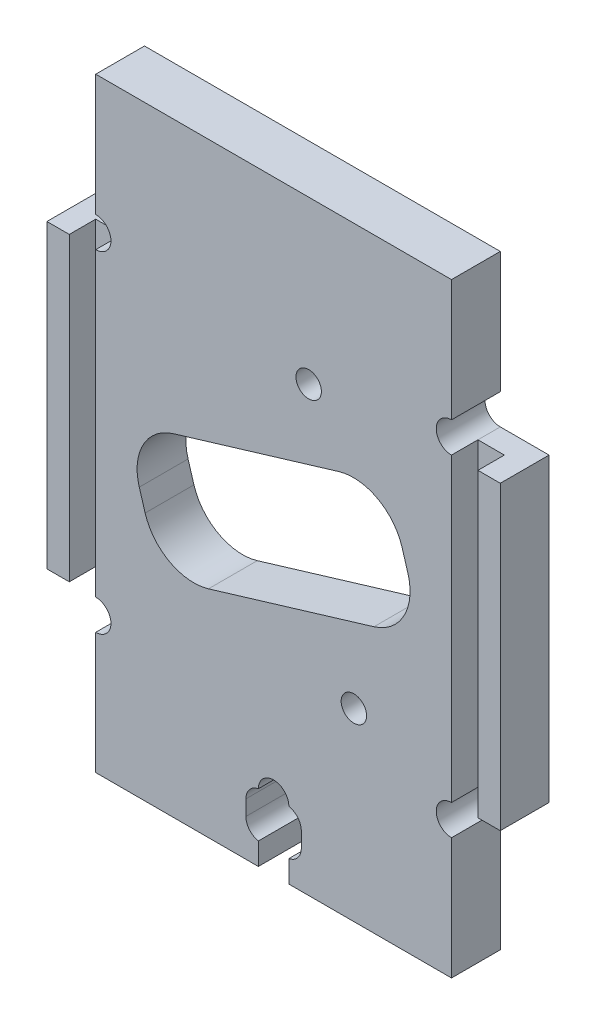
ISO-10303-21;
HEADER;
FILE_DESCRIPTION(('STEP AP214'),'2;1');
FILE_NAME('part.step','',(''),(''),'','','');
FILE_SCHEMA(('AUTOMOTIVE_DESIGN { 1 0 10303 214 1 1 1 1 }'));
ENDSEC;
DATA;
#1=APPLICATION_CONTEXT('core data for automotive mechanical design processes');
#2=APPLICATION_PROTOCOL_DEFINITION('international standard','automotive_design',2000,#1);
#3=PRODUCT_CONTEXT('',#1,'mechanical');
#4=PRODUCT('Part','Part','',(#3));
#5=PRODUCT_RELATED_PRODUCT_CATEGORY('part','',(#4));
#6=PRODUCT_DEFINITION_FORMATION('','',#4);
#7=PRODUCT_DEFINITION_CONTEXT('part definition',#1,'design');
#8=PRODUCT_DEFINITION('design','',#6,#7);
#9=PRODUCT_DEFINITION_SHAPE('','',#8);
#10=(LENGTH_UNIT() NAMED_UNIT(*) SI_UNIT(.MILLI.,.METRE.));
#11=(NAMED_UNIT(*) PLANE_ANGLE_UNIT() SI_UNIT($,.RADIAN.));
#12=(NAMED_UNIT(*) SI_UNIT($,.STERADIAN.) SOLID_ANGLE_UNIT());
#13=UNCERTAINTY_MEASURE_WITH_UNIT(LENGTH_MEASURE(1.E-05),#10,'distance_accuracy_value','');
#14=(GEOMETRIC_REPRESENTATION_CONTEXT(3) GLOBAL_UNCERTAINTY_ASSIGNED_CONTEXT((#13)) GLOBAL_UNIT_ASSIGNED_CONTEXT((#10,
#11,#12)) REPRESENTATION_CONTEXT('',''));
#15=CARTESIAN_POINT('',(0.,0.,0.));
#16=DIRECTION('',(0.,0.,1.));
#17=DIRECTION('',(1.,0.,0.));
#18=AXIS2_PLACEMENT_3D('',#15,#16,#17);
#19=CARTESIAN_POINT('',(-17.5,-15.95,-69.7151058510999));
#20=DIRECTION('',(0.,0.,1.));
#21=DIRECTION('',(1.,0.,0.));
#22=AXIS2_PLACEMENT_3D('',#19,#20,#21);
#23=CYLINDRICAL_SURFACE('',#22,1.5);
#24=CARTESIAN_POINT('',(-17.5,-15.95,0.));
#25=DIRECTION('',(0.,0.,-1.));
#26=DIRECTION('',(-1.,0.,0.));
#27=AXIS2_PLACEMENT_3D('',#24,#25,#26);
#28=CIRCLE('',#27,1.5);
#29=CARTESIAN_POINT('',(-17.5,-14.45,0.));
#30=VERTEX_POINT('',#29);
#31=CARTESIAN_POINT('',(-17.5,-17.45,0.));
#32=VERTEX_POINT('',#31);
#33=EDGE_CURVE('E511',#30,#32,#28,.T.);
#34=ORIENTED_EDGE('',*,*,#33,.T.);
#35=DIRECTION('',(0.,0.,1.));
#36=VECTOR('',#35,1.);
#37=CARTESIAN_POINT('',(-17.5,-17.45,-69.7151058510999));
#38=LINE('',#37,#36);
#39=CARTESIAN_POINT('',(-17.5,-17.45,4.8));
#40=VERTEX_POINT('',#39);
#41=EDGE_CURVE('E364',#32,#40,#38,.T.);
#42=ORIENTED_EDGE('',*,*,#41,.T.);
#43=CARTESIAN_POINT('',(-17.5,-15.95,4.8));
#44=DIRECTION('',(0.,0.,1.));
#45=DIRECTION('',(-1.,0.,0.));
#46=AXIS2_PLACEMENT_3D('',#43,#44,#45);
#47=CIRCLE('',#46,1.5);
#48=CARTESIAN_POINT('',(-17.5,-14.45,4.8));
#49=VERTEX_POINT('',#48);
#50=EDGE_CURVE('E362',#40,#49,#47,.T.);
#51=ORIENTED_EDGE('',*,*,#50,.T.);
#52=DIRECTION('',(0.,0.,1.));
#53=VECTOR('',#52,1.);
#54=CARTESIAN_POINT('',(-17.5,-14.45,-69.7151058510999));
#55=LINE('',#54,#53);
#56=CARTESIAN_POINT('',(-17.5,-14.45,2.2));
#57=VERTEX_POINT('',#56);
#58=EDGE_CURVE('E348',#57,#49,#55,.T.);
#59=ORIENTED_EDGE('',*,*,#58,.F.);
#60=DIRECTION('',(0.,0.,-1.));
#61=VECTOR('',#60,1.);
#62=CARTESIAN_POINT('',(-17.5,-14.45,2.2));
#63=LINE('',#62,#61);
#64=EDGE_CURVE('E489',#57,#30,#63,.T.);
#65=ORIENTED_EDGE('',*,*,#64,.T.);
#66=EDGE_LOOP('',(#34,#42,#51,#59,#65));
#67=FACE_BOUND('',#66,.T.);
#68=ADVANCED_FACE('F16',(#67),#23,.F.);
#69=CARTESIAN_POINT('',(17.5,-15.95,-69.7151058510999));
#70=DIRECTION('',(0.,0.,1.));
#71=DIRECTION('',(1.,0.,0.));
#72=AXIS2_PLACEMENT_3D('',#69,#70,#71);
#73=CYLINDRICAL_SURFACE('',#72,1.5);
#74=DIRECTION('',(0.,0.,-1.));
#75=VECTOR('',#74,1.);
#76=CARTESIAN_POINT('',(17.5,-14.45,2.2));
#77=LINE('',#76,#75);
#78=CARTESIAN_POINT('',(17.5,-14.45,2.2));
#79=VERTEX_POINT('',#78);
#80=CARTESIAN_POINT('',(17.5,-14.45,0.));
#81=VERTEX_POINT('',#80);
#82=EDGE_CURVE('E129',#79,#81,#77,.T.);
#83=ORIENTED_EDGE('',*,*,#82,.F.);
#84=DIRECTION('',(0.,0.,1.));
#85=VECTOR('',#84,1.);
#86=CARTESIAN_POINT('',(17.5,-14.45,-69.7151058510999));
#87=LINE('',#86,#85);
#88=CARTESIAN_POINT('',(17.5,-14.45,4.8));
#89=VERTEX_POINT('',#88);
#90=EDGE_CURVE('E531',#79,#89,#87,.T.);
#91=ORIENTED_EDGE('',*,*,#90,.T.);
#92=CARTESIAN_POINT('',(17.5,-15.95,4.8));
#93=DIRECTION('',(0.,0.,-1.));
#94=DIRECTION('',(1.,0.,0.));
#95=AXIS2_PLACEMENT_3D('',#92,#93,#94);
#96=CIRCLE('',#95,1.5);
#97=CARTESIAN_POINT('',(17.5,-17.45,4.8));
#98=VERTEX_POINT('',#97);
#99=EDGE_CURVE('E539',#98,#89,#96,.T.);
#100=ORIENTED_EDGE('',*,*,#99,.F.);
#101=DIRECTION('',(0.,0.,1.));
#102=VECTOR('',#101,1.);
#103=CARTESIAN_POINT('',(17.5,-17.45,-69.7151058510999));
#104=LINE('',#103,#102);
#105=CARTESIAN_POINT('',(17.5,-17.45,0.));
#106=VERTEX_POINT('',#105);
#107=EDGE_CURVE('E460',#106,#98,#104,.T.);
#108=ORIENTED_EDGE('',*,*,#107,.F.);
#109=CARTESIAN_POINT('',(17.5,-15.95,0.));
#110=DIRECTION('',(0.,0.,1.));
#111=DIRECTION('',(-1.,0.,0.));
#112=AXIS2_PLACEMENT_3D('',#109,#110,#111);
#113=CIRCLE('',#112,1.5);
#114=EDGE_CURVE('E569',#81,#106,#113,.T.);
#115=ORIENTED_EDGE('',*,*,#114,.F.);
#116=EDGE_LOOP('',(#83,#91,#100,#108,#115));
#117=FACE_BOUND('',#116,.T.);
#118=ADVANCED_FACE('F840',(#117),#73,.F.);
#119=CARTESIAN_POINT('',(17.5,16.65,-69.7151058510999));
#120=DIRECTION('',(0.,0.,1.));
#121=DIRECTION('',(1.,0.,0.));
#122=AXIS2_PLACEMENT_3D('',#119,#120,#121);
#123=CYLINDRICAL_SURFACE('',#122,1.5);
#124=CARTESIAN_POINT('',(17.5,16.65,0.));
#125=DIRECTION('',(0.,0.,-1.));
#126=DIRECTION('',(-1.,0.,0.));
#127=AXIS2_PLACEMENT_3D('',#124,#125,#126);
#128=CIRCLE('',#127,1.5);
#129=CARTESIAN_POINT('',(17.5,15.15,0.));
#130=VERTEX_POINT('',#129);
#131=CARTESIAN_POINT('',(17.5,18.15,0.));
#132=VERTEX_POINT('',#131);
#133=EDGE_CURVE('E461',#130,#132,#128,.T.);
#134=ORIENTED_EDGE('',*,*,#133,.T.);
#135=DIRECTION('',(0.,0.,1.));
#136=VECTOR('',#135,1.);
#137=CARTESIAN_POINT('',(17.5,18.15,-69.7151058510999));
#138=LINE('',#137,#136);
#139=CARTESIAN_POINT('',(17.5,18.15,4.8));
#140=VERTEX_POINT('',#139);
#141=EDGE_CURVE('E459',#132,#140,#138,.T.);
#142=ORIENTED_EDGE('',*,*,#141,.T.);
#143=CARTESIAN_POINT('',(17.5,16.65,4.8));
#144=DIRECTION('',(0.,0.,1.));
#145=DIRECTION('',(1.,0.,0.));
#146=AXIS2_PLACEMENT_3D('',#143,#144,#145);
#147=CIRCLE('',#146,1.5);
#148=CARTESIAN_POINT('',(17.5,15.15,4.8));
#149=VERTEX_POINT('',#148);
#150=EDGE_CURVE('E521',#140,#149,#147,.T.);
#151=ORIENTED_EDGE('',*,*,#150,.T.);
#152=DIRECTION('',(0.,0.,1.));
#153=VECTOR('',#152,1.);
#154=CARTESIAN_POINT('',(17.5,15.15,-69.7151058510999));
#155=LINE('',#154,#153);
#156=CARTESIAN_POINT('',(17.5,15.15,2.2));
#157=VERTEX_POINT('',#156);
#158=EDGE_CURVE('E660',#157,#149,#155,.T.);
#159=ORIENTED_EDGE('',*,*,#158,.F.);
#160=DIRECTION('',(0.,0.,1.));
#161=VECTOR('',#160,1.);
#162=CARTESIAN_POINT('',(17.5,15.15,0.));
#163=LINE('',#162,#161);
#164=EDGE_CURVE('E10',#130,#157,#163,.T.);
#165=ORIENTED_EDGE('',*,*,#164,.F.);
#166=EDGE_LOOP('',(#134,#142,#151,#159,#165));
#167=FACE_BOUND('',#166,.T.);
#168=ADVANCED_FACE('F815',(#167),#123,.F.);
#169=CARTESIAN_POINT('',(-17.5,16.65,-69.7151058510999));
#170=DIRECTION('',(0.,0.,1.));
#171=DIRECTION('',(1.,0.,0.));
#172=AXIS2_PLACEMENT_3D('',#169,#170,#171);
#173=CYLINDRICAL_SURFACE('',#172,1.5);
#174=DIRECTION('',(0.,0.,1.));
#175=VECTOR('',#174,1.);
#176=CARTESIAN_POINT('',(-17.5,15.15,0.));
#177=LINE('',#176,#175);
#178=CARTESIAN_POINT('',(-17.5,15.15,0.));
#179=VERTEX_POINT('',#178);
#180=CARTESIAN_POINT('',(-17.5,15.15,2.2));
#181=VERTEX_POINT('',#180);
#182=EDGE_CURVE('E27',#179,#181,#177,.T.);
#183=ORIENTED_EDGE('',*,*,#182,.T.);
#184=DIRECTION('',(0.,0.,1.));
#185=VECTOR('',#184,1.);
#186=CARTESIAN_POINT('',(-17.5,15.15,-69.7151058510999));
#187=LINE('',#186,#185);
#188=CARTESIAN_POINT('',(-17.5,15.15,4.8));
#189=VERTEX_POINT('',#188);
#190=EDGE_CURVE('E358',#181,#189,#187,.T.);
#191=ORIENTED_EDGE('',*,*,#190,.T.);
#192=CARTESIAN_POINT('',(-17.5,16.65,4.8));
#193=DIRECTION('',(0.,0.,-1.));
#194=DIRECTION('',(-1.,0.,0.));
#195=AXIS2_PLACEMENT_3D('',#192,#193,#194);
#196=CIRCLE('',#195,1.5);
#197=CARTESIAN_POINT('',(-17.5,18.15,4.8));
#198=VERTEX_POINT('',#197);
#199=EDGE_CURVE('E376',#198,#189,#196,.T.);
#200=ORIENTED_EDGE('',*,*,#199,.F.);
#201=DIRECTION('',(0.,0.,1.));
#202=VECTOR('',#201,1.);
#203=CARTESIAN_POINT('',(-17.5,18.15,-69.7151058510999));
#204=LINE('',#203,#202);
#205=CARTESIAN_POINT('',(-17.5,18.15,0.));
#206=VERTEX_POINT('',#205);
#207=EDGE_CURVE('E634',#206,#198,#204,.T.);
#208=ORIENTED_EDGE('',*,*,#207,.F.);
#209=CARTESIAN_POINT('',(-17.5,16.65,0.));
#210=DIRECTION('',(0.,0.,1.));
#211=DIRECTION('',(-1.,0.,0.));
#212=AXIS2_PLACEMENT_3D('',#209,#210,#211);
#213=CIRCLE('',#212,1.5);
#214=EDGE_CURVE('E628',#179,#206,#213,.T.);
#215=ORIENTED_EDGE('',*,*,#214,.F.);
#216=EDGE_LOOP('',(#183,#191,#200,#208,#215));
#217=FACE_BOUND('',#216,.T.);
#218=ADVANCED_FACE('F18',(#217),#173,.F.);
#219=CARTESIAN_POINT('',(0.,15.15,0.));
#220=DIRECTION('',(0.,1.,0.));
#221=DIRECTION('',(1.,0.,0.));
#222=AXIS2_PLACEMENT_3D('',#219,#220,#221);
#223=PLANE('',#222);
#224=DIRECTION('',(0.,0.,1.));
#225=VECTOR('',#224,1.);
#226=CARTESIAN_POINT('',(20.1,15.15,2.2));
#227=LINE('',#226,#225);
#228=CARTESIAN_POINT('',(20.1,15.15,2.2));
#229=VERTEX_POINT('',#228);
#230=CARTESIAN_POINT('',(20.1,15.15,4.8));
#231=VERTEX_POINT('',#230);
#232=EDGE_CURVE('E624',#229,#231,#227,.T.);
#233=ORIENTED_EDGE('',*,*,#232,.T.);
#234=DIRECTION('',(1.,0.,0.));
#235=VECTOR('',#234,1.);
#236=CARTESIAN_POINT('',(20.1,15.15,4.8));
#237=LINE('',#236,#235);
#238=CARTESIAN_POINT('',(22.3,15.15,4.8));
#239=VERTEX_POINT('',#238);
#240=EDGE_CURVE('E492',#231,#239,#237,.T.);
#241=ORIENTED_EDGE('',*,*,#240,.T.);
#242=DIRECTION('',(0.,0.,-1.));
#243=VECTOR('',#242,1.);
#244=CARTESIAN_POINT('',(22.3,15.15,4.8));
#245=LINE('',#244,#243);
#246=CARTESIAN_POINT('',(22.3,15.15,0.));
#247=VERTEX_POINT('',#246);
#248=EDGE_CURVE('E484',#239,#247,#245,.T.);
#249=ORIENTED_EDGE('',*,*,#248,.T.);
#250=DIRECTION('',(-1.,0.,0.));
#251=VECTOR('',#250,1.);
#252=CARTESIAN_POINT('',(22.3,15.15,0.));
#253=LINE('',#252,#251);
#254=EDGE_CURVE('E465',#247,#130,#253,.T.);
#255=ORIENTED_EDGE('',*,*,#254,.T.);
#256=ORIENTED_EDGE('',*,*,#164,.T.);
#257=DIRECTION('',(1.,0.,0.));
#258=VECTOR('',#257,1.);
#259=CARTESIAN_POINT('',(17.5,15.15,2.2));
#260=LINE('',#259,#258);
#261=EDGE_CURVE('E664',#157,#229,#260,.T.);
#262=ORIENTED_EDGE('',*,*,#261,.T.);
#263=EDGE_LOOP('',(#233,#241,#249,#255,#256,#262));
#264=FACE_BOUND('',#263,.T.);
#265=ADVANCED_FACE('F819',(#264),#223,.T.);
#266=CARTESIAN_POINT('',(0.,15.15,0.));
#267=DIRECTION('',(0.,-1.,0.));
#268=DIRECTION('',(0.,0.,-1.));
#269=AXIS2_PLACEMENT_3D('',#266,#267,#268);
#270=PLANE('',#269);
#271=DIRECTION('',(-1.,0.,0.));
#272=VECTOR('',#271,1.);
#273=CARTESIAN_POINT('',(-20.1,15.15,4.8));
#274=LINE('',#273,#272);
#275=CARTESIAN_POINT('',(-20.1,15.15,4.8));
#276=VERTEX_POINT('',#275);
#277=CARTESIAN_POINT('',(-22.3,15.15,4.8));
#278=VERTEX_POINT('',#277);
#279=EDGE_CURVE('E405',#276,#278,#274,.T.);
#280=ORIENTED_EDGE('',*,*,#279,.F.);
#281=DIRECTION('',(0.,0.,1.));
#282=VECTOR('',#281,1.);
#283=CARTESIAN_POINT('',(-20.1,15.15,2.2));
#284=LINE('',#283,#282);
#285=CARTESIAN_POINT('',(-20.1,15.15,2.2));
#286=VERTEX_POINT('',#285);
#287=EDGE_CURVE('E71',#286,#276,#284,.T.);
#288=ORIENTED_EDGE('',*,*,#287,.F.);
#289=DIRECTION('',(-1.,0.,0.));
#290=VECTOR('',#289,1.);
#291=CARTESIAN_POINT('',(-17.5,15.15,2.2));
#292=LINE('',#291,#290);
#293=EDGE_CURVE('E674',#181,#286,#292,.T.);
#294=ORIENTED_EDGE('',*,*,#293,.F.);
#295=ORIENTED_EDGE('',*,*,#182,.F.);
#296=DIRECTION('',(1.,0.,0.));
#297=VECTOR('',#296,1.);
#298=CARTESIAN_POINT('',(-22.3,15.15,0.));
#299=LINE('',#298,#297);
#300=CARTESIAN_POINT('',(-22.3,15.15,0.));
#301=VERTEX_POINT('',#300);
#302=EDGE_CURVE('E453',#301,#179,#299,.T.);
#303=ORIENTED_EDGE('',*,*,#302,.F.);
#304=DIRECTION('',(0.,0.,-1.));
#305=VECTOR('',#304,1.);
#306=CARTESIAN_POINT('',(-22.3,15.15,4.8));
#307=LINE('',#306,#305);
#308=EDGE_CURVE('E488',#278,#301,#307,.T.);
#309=ORIENTED_EDGE('',*,*,#308,.F.);
#310=EDGE_LOOP('',(#280,#288,#294,#295,#303,#309));
#311=FACE_BOUND('',#310,.T.);
#312=ADVANCED_FACE('F771',(#311),#270,.F.);
#313=CARTESIAN_POINT('',(0.,-14.45,0.));
#314=DIRECTION('',(0.,-1.,0.));
#315=DIRECTION('',(0.,0.,-1.));
#316=AXIS2_PLACEMENT_3D('',#313,#314,#315);
#317=PLANE('',#316);
#318=DIRECTION('',(0.,0.,1.));
#319=VECTOR('',#318,1.);
#320=CARTESIAN_POINT('',(22.3,-14.45,0.));
#321=LINE('',#320,#319);
#322=CARTESIAN_POINT('',(22.3,-14.45,0.));
#323=VERTEX_POINT('',#322);
#324=CARTESIAN_POINT('',(22.3,-14.45,4.8));
#325=VERTEX_POINT('',#324);
#326=EDGE_CURVE('E140',#323,#325,#321,.T.);
#327=ORIENTED_EDGE('',*,*,#326,.T.);
#328=DIRECTION('',(-1.,0.,0.));
#329=VECTOR('',#328,1.);
#330=CARTESIAN_POINT('',(22.3,-14.45,4.8));
#331=LINE('',#330,#329);
#332=CARTESIAN_POINT('',(20.1,-14.45,4.8));
#333=VERTEX_POINT('',#332);
#334=EDGE_CURVE('E41',#325,#333,#331,.T.);
#335=ORIENTED_EDGE('',*,*,#334,.T.);
#336=DIRECTION('',(0.,0.,-1.));
#337=VECTOR('',#336,1.);
#338=CARTESIAN_POINT('',(20.1,-14.45,4.8));
#339=LINE('',#338,#337);
#340=CARTESIAN_POINT('',(20.1,-14.45,2.2));
#341=VERTEX_POINT('',#340);
#342=EDGE_CURVE('E621',#333,#341,#339,.T.);
#343=ORIENTED_EDGE('',*,*,#342,.T.);
#344=DIRECTION('',(-1.,0.,0.));
#345=VECTOR('',#344,1.);
#346=CARTESIAN_POINT('',(20.1,-14.45,2.2));
#347=LINE('',#346,#345);
#348=EDGE_CURVE('E579',#341,#79,#347,.T.);
#349=ORIENTED_EDGE('',*,*,#348,.T.);
#350=ORIENTED_EDGE('',*,*,#82,.T.);
#351=DIRECTION('',(1.,0.,0.));
#352=VECTOR('',#351,1.);
#353=CARTESIAN_POINT('',(17.5,-14.45,0.));
#354=LINE('',#353,#352);
#355=EDGE_CURVE('E574',#81,#323,#354,.T.);
#356=ORIENTED_EDGE('',*,*,#355,.T.);
#357=EDGE_LOOP('',(#327,#335,#343,#349,#350,#356));
#358=FACE_BOUND('',#357,.T.);
#359=ADVANCED_FACE('F824',(#358),#317,.T.);
#360=CARTESIAN_POINT('',(0.,-14.45,0.));
#361=DIRECTION('',(0.,1.,0.));
#362=DIRECTION('',(1.,0.,0.));
#363=AXIS2_PLACEMENT_3D('',#360,#361,#362);
#364=PLANE('',#363);
#365=DIRECTION('',(0.,0.,1.));
#366=VECTOR('',#365,1.);
#367=CARTESIAN_POINT('',(-22.3,-14.45,0.));
#368=LINE('',#367,#366);
#369=CARTESIAN_POINT('',(-22.3,-14.45,0.));
#370=VERTEX_POINT('',#369);
#371=CARTESIAN_POINT('',(-22.3,-14.45,4.8));
#372=VERTEX_POINT('',#371);
#373=EDGE_CURVE('E406',#370,#372,#368,.T.);
#374=ORIENTED_EDGE('',*,*,#373,.F.);
#375=DIRECTION('',(-1.,0.,0.));
#376=VECTOR('',#375,1.);
#377=CARTESIAN_POINT('',(-17.5,-14.45,0.));
#378=LINE('',#377,#376);
#379=EDGE_CURVE('E454',#30,#370,#378,.T.);
#380=ORIENTED_EDGE('',*,*,#379,.F.);
#381=ORIENTED_EDGE('',*,*,#64,.F.);
#382=DIRECTION('',(1.,0.,0.));
#383=VECTOR('',#382,1.);
#384=CARTESIAN_POINT('',(-20.1,-14.45,2.2));
#385=LINE('',#384,#383);
#386=CARTESIAN_POINT('',(-20.1,-14.45,2.2));
#387=VERTEX_POINT('',#386);
#388=EDGE_CURVE('E425',#387,#57,#385,.T.);
#389=ORIENTED_EDGE('',*,*,#388,.F.);
#390=DIRECTION('',(0.,0.,-1.));
#391=VECTOR('',#390,1.);
#392=CARTESIAN_POINT('',(-20.1,-14.45,4.8));
#393=LINE('',#392,#391);
#394=CARTESIAN_POINT('',(-20.1,-14.45,4.8));
#395=VERTEX_POINT('',#394);
#396=EDGE_CURVE('E442',#395,#387,#393,.T.);
#397=ORIENTED_EDGE('',*,*,#396,.F.);
#398=DIRECTION('',(1.,0.,0.));
#399=VECTOR('',#398,1.);
#400=CARTESIAN_POINT('',(-22.3,-14.45,4.8));
#401=LINE('',#400,#399);
#402=EDGE_CURVE('E402',#372,#395,#401,.T.);
#403=ORIENTED_EDGE('',*,*,#402,.F.);
#404=EDGE_LOOP('',(#374,#380,#381,#389,#397,#403));
#405=FACE_BOUND('',#404,.T.);
#406=ADVANCED_FACE('F782',(#405),#364,.F.);
#407=CARTESIAN_POINT('',(0.,-29.4,0.));
#408=DIRECTION('',(0.,1.,0.));
#409=DIRECTION('',(1.,0.,0.));
#410=AXIS2_PLACEMENT_3D('',#407,#408,#409);
#411=PLANE('',#410);
#412=DIRECTION('',(0.,0.,1.));
#413=VECTOR('',#412,1.);
#414=CARTESIAN_POINT('',(1.5,-29.4,0.));
#415=LINE('',#414,#413);
#416=CARTESIAN_POINT('',(1.5,-29.4,0.));
#417=VERTEX_POINT('',#416);
#418=CARTESIAN_POINT('',(1.5,-29.4,4.8));
#419=VERTEX_POINT('',#418);
#420=EDGE_CURVE('E515',#417,#419,#415,.T.);
#421=ORIENTED_EDGE('',*,*,#420,.F.);
#422=DIRECTION('',(-1.,0.,0.));
#423=VECTOR('',#422,1.);
#424=CARTESIAN_POINT('',(17.5,-29.4,0.));
#425=LINE('',#424,#423);
#426=CARTESIAN_POINT('',(17.5,-29.4,0.));
#427=VERTEX_POINT('',#426);
#428=EDGE_CURVE('E683',#427,#417,#425,.T.);
#429=ORIENTED_EDGE('',*,*,#428,.F.);
#430=DIRECTION('',(0.,0.,-1.));
#431=VECTOR('',#430,1.);
#432=CARTESIAN_POINT('',(17.5,-29.4,4.8));
#433=LINE('',#432,#431);
#434=CARTESIAN_POINT('',(17.5,-29.4,4.8));
#435=VERTEX_POINT('',#434);
#436=EDGE_CURVE('E455',#435,#427,#433,.T.);
#437=ORIENTED_EDGE('',*,*,#436,.F.);
#438=DIRECTION('',(1.,0.,0.));
#439=VECTOR('',#438,1.);
#440=CARTESIAN_POINT('',(1.5,-29.4,4.8));
#441=LINE('',#440,#439);
#442=EDGE_CURVE('E540',#419,#435,#441,.T.);
#443=ORIENTED_EDGE('',*,*,#442,.F.);
#444=EDGE_LOOP('',(#421,#429,#437,#443));
#445=FACE_BOUND('',#444,.T.);
#446=ADVANCED_FACE('F866',(#445),#411,.F.);
#447=CARTESIAN_POINT('',(0.,-29.4,0.));
#448=DIRECTION('',(0.,1.,0.));
#449=DIRECTION('',(1.,0.,0.));
#450=AXIS2_PLACEMENT_3D('',#447,#448,#449);
#451=PLANE('',#450);
#452=DIRECTION('',(0.,0.,1.));
#453=VECTOR('',#452,1.);
#454=CARTESIAN_POINT('',(-17.5,-29.4,0.));
#455=LINE('',#454,#453);
#456=CARTESIAN_POINT('',(-17.5,-29.4,0.));
#457=VERTEX_POINT('',#456);
#458=CARTESIAN_POINT('',(-17.5,-29.4,4.8));
#459=VERTEX_POINT('',#458);
#460=EDGE_CURVE('E483',#457,#459,#455,.T.);
#461=ORIENTED_EDGE('',*,*,#460,.F.);
#462=DIRECTION('',(-1.,0.,0.));
#463=VECTOR('',#462,1.);
#464=CARTESIAN_POINT('',(-1.5,-29.4,0.));
#465=LINE('',#464,#463);
#466=CARTESIAN_POINT('',(-1.5,-29.4,0.));
#467=VERTEX_POINT('',#466);
#468=EDGE_CURVE('E411',#467,#457,#465,.T.);
#469=ORIENTED_EDGE('',*,*,#468,.F.);
#470=DIRECTION('',(0.,0.,-1.));
#471=VECTOR('',#470,1.);
#472=CARTESIAN_POINT('',(-1.5,-29.4,4.8));
#473=LINE('',#472,#471);
#474=CARTESIAN_POINT('',(-1.5,-29.4,4.8));
#475=VERTEX_POINT('',#474);
#476=EDGE_CURVE('E20',#475,#467,#473,.T.);
#477=ORIENTED_EDGE('',*,*,#476,.F.);
#478=DIRECTION('',(1.,0.,0.));
#479=VECTOR('',#478,1.);
#480=CARTESIAN_POINT('',(-17.5,-29.4,4.8));
#481=LINE('',#480,#479);
#482=EDGE_CURVE('E369',#459,#475,#481,.T.);
#483=ORIENTED_EDGE('',*,*,#482,.F.);
#484=EDGE_LOOP('',(#461,#469,#477,#483));
#485=FACE_BOUND('',#484,.T.);
#486=ADVANCED_FACE('F1064',(#485),#451,.F.);
#487=CARTESIAN_POINT('',(0.,30.1,0.));
#488=DIRECTION('',(0.,-1.,0.));
#489=DIRECTION('',(0.,0.,-1.));
#490=AXIS2_PLACEMENT_3D('',#487,#488,#489);
#491=PLANE('',#490);
#492=DIRECTION('',(0.,0.,-1.));
#493=VECTOR('',#492,1.);
#494=CARTESIAN_POINT('',(-17.5,30.1,4.8));
#495=LINE('',#494,#493);
#496=CARTESIAN_POINT('',(-17.5,30.1,4.8));
#497=VERTEX_POINT('',#496);
#498=CARTESIAN_POINT('',(-17.5,30.1,0.));
#499=VERTEX_POINT('',#498);
#500=EDGE_CURVE('E583',#497,#499,#495,.T.);
#501=ORIENTED_EDGE('',*,*,#500,.F.);
#502=DIRECTION('',(-1.,0.,0.));
#503=VECTOR('',#502,1.);
#504=CARTESIAN_POINT('',(17.5,30.1,4.8));
#505=LINE('',#504,#503);
#506=CARTESIAN_POINT('',(17.5,30.1,4.8));
#507=VERTEX_POINT('',#506);
#508=EDGE_CURVE('E568',#507,#497,#505,.T.);
#509=ORIENTED_EDGE('',*,*,#508,.F.);
#510=DIRECTION('',(0.,0.,1.));
#511=VECTOR('',#510,1.);
#512=CARTESIAN_POINT('',(17.5,30.1,0.));
#513=LINE('',#512,#511);
#514=CARTESIAN_POINT('',(17.5,30.1,0.));
#515=VERTEX_POINT('',#514);
#516=EDGE_CURVE('E359',#515,#507,#513,.T.);
#517=ORIENTED_EDGE('',*,*,#516,.F.);
#518=DIRECTION('',(1.,0.,0.));
#519=VECTOR('',#518,1.);
#520=CARTESIAN_POINT('',(-17.5,30.1,0.));
#521=LINE('',#520,#519);
#522=EDGE_CURVE('E503',#499,#515,#521,.T.);
#523=ORIENTED_EDGE('',*,*,#522,.F.);
#524=EDGE_LOOP('',(#501,#509,#517,#523));
#525=FACE_BOUND('',#524,.T.);
#526=ADVANCED_FACE('F807',(#525),#491,.F.);
#527=CARTESIAN_POINT('',(0.,0.,4.8));
#528=DIRECTION('',(0.,0.,-1.));
#529=DIRECTION('',(0.,-1.,0.));
#530=AXIS2_PLACEMENT_3D('',#527,#528,#529);
#531=PLANE('',#530);
#532=DIRECTION('',(0.,-1.,0.));
#533=VECTOR('',#532,1.);
#534=CARTESIAN_POINT('',(20.1,14.75,4.8));
#535=LINE('',#534,#533);
#536=EDGE_CURVE('E668',#231,#333,#535,.T.);
#537=ORIENTED_EDGE('',*,*,#536,.T.);
#538=ORIENTED_EDGE('',*,*,#334,.F.);
#539=DIRECTION('',(0.,-1.,0.));
#540=VECTOR('',#539,1.);
#541=CARTESIAN_POINT('',(22.3,-0.25,4.8));
#542=LINE('',#541,#540);
#543=EDGE_CURVE('E487',#239,#325,#542,.T.);
#544=ORIENTED_EDGE('',*,*,#543,.F.);
#545=ORIENTED_EDGE('',*,*,#240,.F.);
#546=EDGE_LOOP('',(#537,#538,#544,#545));
#547=FACE_BOUND('',#546,.T.);
#548=ADVANCED_FACE('F825',(#547),#531,.F.);
#549=CARTESIAN_POINT('',(0.,0.,4.8));
#550=DIRECTION('',(0.,0.,-1.));
#551=DIRECTION('',(0.,-1.,0.));
#552=AXIS2_PLACEMENT_3D('',#549,#550,#551);
#553=PLANE('',#552);
#554=DIRECTION('',(0.,1.,0.));
#555=VECTOR('',#554,1.);
#556=CARTESIAN_POINT('',(-22.3,-0.25,4.8));
#557=LINE('',#556,#555);
#558=EDGE_CURVE('E410',#372,#278,#557,.T.);
#559=ORIENTED_EDGE('',*,*,#558,.F.);
#560=ORIENTED_EDGE('',*,*,#402,.T.);
#561=DIRECTION('',(0.,-1.,0.));
#562=VECTOR('',#561,1.);
#563=CARTESIAN_POINT('',(-20.1,14.75,4.8));
#564=LINE('',#563,#562);
#565=EDGE_CURVE('E429',#276,#395,#564,.T.);
#566=ORIENTED_EDGE('',*,*,#565,.F.);
#567=ORIENTED_EDGE('',*,*,#279,.T.);
#568=EDGE_LOOP('',(#559,#560,#566,#567));
#569=FACE_BOUND('',#568,.T.);
#570=ADVANCED_FACE('F788',(#569),#553,.F.);
#571=CARTESIAN_POINT('',(22.3,-0.25,4.8));
#572=DIRECTION('',(1.,0.,0.));
#573=DIRECTION('',(0.,1.,0.));
#574=AXIS2_PLACEMENT_3D('',#571,#572,#573);
#575=PLANE('',#574);
#576=DIRECTION('',(0.,-1.,0.));
#577=VECTOR('',#576,1.);
#578=CARTESIAN_POINT('',(22.3,-0.25,0.));
#579=LINE('',#578,#577);
#580=EDGE_CURVE('E595',#247,#323,#579,.T.);
#581=ORIENTED_EDGE('',*,*,#580,.F.);
#582=ORIENTED_EDGE('',*,*,#248,.F.);
#583=ORIENTED_EDGE('',*,*,#543,.T.);
#584=ORIENTED_EDGE('',*,*,#326,.F.);
#585=EDGE_LOOP('',(#581,#582,#583,#584));
#586=FACE_BOUND('',#585,.T.);
#587=ADVANCED_FACE('F821',(#586),#575,.T.);
#588=CARTESIAN_POINT('',(-22.3,-0.25,4.8));
#589=DIRECTION('',(-1.,0.,0.));
#590=DIRECTION('',(0.,0.,1.));
#591=AXIS2_PLACEMENT_3D('',#588,#589,#590);
#592=PLANE('',#591);
#593=DIRECTION('',(0.,1.,0.));
#594=VECTOR('',#593,1.);
#595=CARTESIAN_POINT('',(-22.3,-0.25,0.));
#596=LINE('',#595,#594);
#597=EDGE_CURVE('E449',#370,#301,#596,.T.);
#598=ORIENTED_EDGE('',*,*,#597,.F.);
#599=ORIENTED_EDGE('',*,*,#373,.T.);
#600=ORIENTED_EDGE('',*,*,#558,.T.);
#601=ORIENTED_EDGE('',*,*,#308,.T.);
#602=EDGE_LOOP('',(#598,#599,#600,#601));
#603=FACE_BOUND('',#602,.T.);
#604=ADVANCED_FACE('F768',(#603),#592,.T.);
#605=CARTESIAN_POINT('',(3.45,14.16,4.8));
#606=DIRECTION('',(0.,0.,-1.));
#607=DIRECTION('',(-1.,0.,0.));
#608=AXIS2_PLACEMENT_3D('',#605,#606,#607);
#609=CYLINDRICAL_SURFACE('',#608,1.25);
#610=CARTESIAN_POINT('',(3.45,14.16,4.8));
#611=DIRECTION('',(0.,0.,-1.));
#612=DIRECTION('',(1.,0.,0.));
#613=AXIS2_PLACEMENT_3D('',#610,#611,#612);
#614=CIRCLE('',#613,1.25);
#615=CARTESIAN_POINT('',(4.7,14.16,4.8));
#616=VERTEX_POINT('',#615);
#617=EDGE_CURVE('E424',#616,#616,#614,.T.);
#618=ORIENTED_EDGE('',*,*,#617,.F.);
#619=EDGE_LOOP('',(#618));
#620=FACE_BOUND('',#619,.T.);
#621=CARTESIAN_POINT('',(3.45,14.16,0.));
#622=DIRECTION('',(0.,0.,-1.));
#623=DIRECTION('',(1.,0.,0.));
#624=AXIS2_PLACEMENT_3D('',#621,#622,#623);
#625=CIRCLE('',#624,1.25);
#626=CARTESIAN_POINT('',(4.7,14.16,0.));
#627=VERTEX_POINT('',#626);
#628=EDGE_CURVE('E395',#627,#627,#625,.T.);
#629=ORIENTED_EDGE('',*,*,#628,.T.);
#630=EDGE_LOOP('',(#629));
#631=FACE_BOUND('',#630,.T.);
#632=ADVANCED_FACE('F1006',(#620,#631),#609,.F.);
#633=CARTESIAN_POINT('',(7.895,-11.24,4.8));
#634=DIRECTION('',(0.,0.,-1.));
#635=DIRECTION('',(-1.,0.,0.));
#636=AXIS2_PLACEMENT_3D('',#633,#634,#635);
#637=CYLINDRICAL_SURFACE('',#636,1.25);
#638=CARTESIAN_POINT('',(7.895,-11.24,4.8));
#639=DIRECTION('',(0.,0.,-1.));
#640=DIRECTION('',(1.,0.,0.));
#641=AXIS2_PLACEMENT_3D('',#638,#639,#640);
#642=CIRCLE('',#641,1.25);
#643=CARTESIAN_POINT('',(9.145,-11.24,4.8));
#644=VERTEX_POINT('',#643);
#645=EDGE_CURVE('E420',#644,#644,#642,.T.);
#646=ORIENTED_EDGE('',*,*,#645,.F.);
#647=EDGE_LOOP('',(#646));
#648=FACE_BOUND('',#647,.T.);
#649=CARTESIAN_POINT('',(7.895,-11.24,0.));
#650=DIRECTION('',(0.,0.,-1.));
#651=DIRECTION('',(1.,0.,0.));
#652=AXIS2_PLACEMENT_3D('',#649,#650,#651);
#653=CIRCLE('',#652,1.25);
#654=CARTESIAN_POINT('',(9.145,-11.24,0.));
#655=VERTEX_POINT('',#654);
#656=EDGE_CURVE('E390',#655,#655,#653,.T.);
#657=ORIENTED_EDGE('',*,*,#656,.T.);
#658=EDGE_LOOP('',(#657));
#659=FACE_BOUND('',#658,.T.);
#660=ADVANCED_FACE('F1001',(#648,#659),#637,.F.);
#661=CARTESIAN_POINT('',(-20.1,14.75,2.2));
#662=DIRECTION('',(-1.,0.,0.));
#663=DIRECTION('',(0.,1.,0.));
#664=AXIS2_PLACEMENT_3D('',#661,#662,#663);
#665=PLANE('',#664);
#666=ORIENTED_EDGE('',*,*,#565,.T.);
#667=ORIENTED_EDGE('',*,*,#396,.T.);
#668=DIRECTION('',(0.,-1.,0.));
#669=VECTOR('',#668,1.);
#670=CARTESIAN_POINT('',(-20.1,14.75,2.2));
#671=LINE('',#670,#669);
#672=EDGE_CURVE('E430',#286,#387,#671,.T.);
#673=ORIENTED_EDGE('',*,*,#672,.F.);
#674=ORIENTED_EDGE('',*,*,#287,.T.);
#675=EDGE_LOOP('',(#666,#667,#673,#674));
#676=FACE_BOUND('',#675,.T.);
#677=ADVANCED_FACE('F792',(#676),#665,.F.);
#678=CARTESIAN_POINT('',(0.,0.,2.2));
#679=DIRECTION('',(0.,0.,1.));
#680=DIRECTION('',(1.,0.,0.));
#681=AXIS2_PLACEMENT_3D('',#678,#679,#680);
#682=PLANE('',#681);
#683=DIRECTION('',(0.,1.,0.));
#684=VECTOR('',#683,1.);
#685=CARTESIAN_POINT('',(-17.5,-15.25,2.2));
#686=LINE('',#685,#684);
#687=EDGE_CURVE('E355',#57,#181,#686,.T.);
#688=ORIENTED_EDGE('',*,*,#687,.T.);
#689=ORIENTED_EDGE('',*,*,#293,.T.);
#690=ORIENTED_EDGE('',*,*,#672,.T.);
#691=ORIENTED_EDGE('',*,*,#388,.T.);
#692=EDGE_LOOP('',(#688,#689,#690,#691));
#693=FACE_BOUND('',#692,.T.);
#694=ADVANCED_FACE('F794',(#693),#682,.T.);
#695=CARTESIAN_POINT('',(7.84937519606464,3.41135003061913,-0.2));
#696=DIRECTION('',(0.,0.,1.));
#697=DIRECTION('',(1.,0.,0.));
#698=AXIS2_PLACEMENT_3D('',#695,#696,#697);
#699=CYLINDRICAL_SURFACE('',#698,5.);
#700=CARTESIAN_POINT('',(7.84937519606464,3.41135003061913,0.));
#701=DIRECTION('',(0.,0.,-1.));
#702=DIRECTION('',(-1.,0.,0.));
#703=AXIS2_PLACEMENT_3D('',#700,#701,#702);
#704=CIRCLE('',#703,5.);
#705=CARTESIAN_POINT('',(6.40588713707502,8.198451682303,0.));
#706=VERTEX_POINT('',#705);
#707=CARTESIAN_POINT('',(12.6364768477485,4.85483808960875,0.));
#708=VERTEX_POINT('',#707);
#709=EDGE_CURVE('E394',#706,#708,#704,.T.);
#710=ORIENTED_EDGE('',*,*,#709,.T.);
#711=DIRECTION('',(0.,0.,1.));
#712=VECTOR('',#711,1.);
#713=CARTESIAN_POINT('',(12.6364768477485,4.85483808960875,-0.2));
#714=LINE('',#713,#712);
#715=CARTESIAN_POINT('',(12.6364768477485,4.85483808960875,4.8));
#716=VERTEX_POINT('',#715);
#717=EDGE_CURVE('E415',#708,#716,#714,.T.);
#718=ORIENTED_EDGE('',*,*,#717,.T.);
#719=CARTESIAN_POINT('',(7.84937519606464,3.41135003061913,4.8));
#720=DIRECTION('',(0.,0.,1.));
#721=DIRECTION('',(1.,0.,0.));
#722=AXIS2_PLACEMENT_3D('',#719,#720,#721);
#723=CIRCLE('',#722,5.);
#724=CARTESIAN_POINT('',(6.40588713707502,8.198451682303,4.8));
#725=VERTEX_POINT('',#724);
#726=EDGE_CURVE('E445',#716,#725,#723,.T.);
#727=ORIENTED_EDGE('',*,*,#726,.T.);
#728=DIRECTION('',(0.,0.,1.));
#729=VECTOR('',#728,1.);
#730=CARTESIAN_POINT('',(6.40588713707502,8.198451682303,-0.2));
#731=LINE('',#730,#729);
#732=EDGE_CURVE('E744',#706,#725,#731,.T.);
#733=ORIENTED_EDGE('',*,*,#732,.F.);
#734=EDGE_LOOP('',(#710,#718,#727,#733));
#735=FACE_BOUND('',#734,.T.);
#736=ADVANCED_FACE('F1075',(#735),#699,.F.);
#737=CARTESIAN_POINT('',(6.40588713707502,8.198451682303,-0.2));
#738=DIRECTION('',(-0.288697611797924,0.957420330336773,0.));
#739=DIRECTION('',(0.,0.,1.));
#740=AXIS2_PLACEMENT_3D('',#737,#738,#739);
#741=PLANE('',#740);
#742=DIRECTION('',(0.957420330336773,0.288697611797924,0.));
#743=VECTOR('',#742,1.);
#744=CARTESIAN_POINT('',(-1.73218567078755,5.74452198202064,0.));
#745=LINE('',#744,#743);
#746=CARTESIAN_POINT('',(-9.87025847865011,3.29059228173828,0.));
#747=VERTEX_POINT('',#746);
#748=EDGE_CURVE('E401',#747,#706,#745,.T.);
#749=ORIENTED_EDGE('',*,*,#748,.T.);
#750=ORIENTED_EDGE('',*,*,#732,.T.);
#751=DIRECTION('',(-0.957420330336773,-0.288697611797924,0.));
#752=VECTOR('',#751,1.);
#753=CARTESIAN_POINT('',(6.40588713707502,8.198451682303,4.8));
#754=LINE('',#753,#752);
#755=CARTESIAN_POINT('',(-9.87025847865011,3.29059228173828,4.8));
#756=VERTEX_POINT('',#755);
#757=EDGE_CURVE('E423',#725,#756,#754,.T.);
#758=ORIENTED_EDGE('',*,*,#757,.T.);
#759=DIRECTION('',(0.,0.,1.));
#760=VECTOR('',#759,1.);
#761=CARTESIAN_POINT('',(-9.87025847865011,3.29059228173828,-0.2));
#762=LINE('',#761,#760);
#763=EDGE_CURVE('E616',#747,#756,#762,.T.);
#764=ORIENTED_EDGE('',*,*,#763,.F.);
#765=EDGE_LOOP('',(#749,#750,#758,#764));
#766=FACE_BOUND('',#765,.T.);
#767=ADVANCED_FACE('F1208',(#766),#741,.F.);
#768=CARTESIAN_POINT('',(-8.42677041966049,-1.49650936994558,-0.2));
#769=DIRECTION('',(0.,0.,1.));
#770=DIRECTION('',(1.,0.,0.));
#771=AXIS2_PLACEMENT_3D('',#768,#769,#770);
#772=CYLINDRICAL_SURFACE('',#771,5.);
#773=CARTESIAN_POINT('',(-8.42677041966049,-1.49650936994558,0.));
#774=DIRECTION('',(0.,0.,-1.));
#775=DIRECTION('',(-1.,0.,0.));
#776=AXIS2_PLACEMENT_3D('',#773,#774,#775);
#777=CIRCLE('',#776,5.);
#778=CARTESIAN_POINT('',(-13.2138720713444,-2.9399974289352,0.));
#779=VERTEX_POINT('',#778);
#780=EDGE_CURVE('E396',#779,#747,#777,.T.);
#781=ORIENTED_EDGE('',*,*,#780,.T.);
#782=ORIENTED_EDGE('',*,*,#763,.T.);
#783=CARTESIAN_POINT('',(-8.42677041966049,-1.49650936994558,4.8));
#784=DIRECTION('',(0.,0.,1.));
#785=DIRECTION('',(1.,0.,0.));
#786=AXIS2_PLACEMENT_3D('',#783,#784,#785);
#787=CIRCLE('',#786,5.);
#788=CARTESIAN_POINT('',(-13.2138720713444,-2.9399974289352,4.8));
#789=VERTEX_POINT('',#788);
#790=EDGE_CURVE('E378',#756,#789,#787,.T.);
#791=ORIENTED_EDGE('',*,*,#790,.T.);
#792=DIRECTION('',(0.,0.,1.));
#793=VECTOR('',#792,1.);
#794=CARTESIAN_POINT('',(-13.2138720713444,-2.9399974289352,-0.2));
#795=LINE('',#794,#793);
#796=EDGE_CURVE('E613',#779,#789,#795,.T.);
#797=ORIENTED_EDGE('',*,*,#796,.F.);
#798=EDGE_LOOP('',(#781,#782,#791,#797));
#799=FACE_BOUND('',#798,.T.);
#800=ADVANCED_FACE('F1213',(#799),#772,.F.);
#801=CARTESIAN_POINT('',(-13.2138720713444,-2.93999742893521,-0.2));
#802=DIRECTION('',(-0.957420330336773,-0.288697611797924,0.));
#803=DIRECTION('',(-0.288697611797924,0.957420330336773,0.));
#804=AXIS2_PLACEMENT_3D('',#801,#802,#803);
#805=PLANE('',#804);
#806=DIRECTION('',(-0.288697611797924,0.957420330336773,0.));
#807=VECTOR('',#806,1.);
#808=CARTESIAN_POINT('',(-12.9251744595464,-3.89741775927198,0.));
#809=LINE('',#808,#807);
#810=CARTESIAN_POINT('',(-12.6364768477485,-4.85483808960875,0.));
#811=VERTEX_POINT('',#810);
#812=EDGE_CURVE('E400',#811,#779,#809,.T.);
#813=ORIENTED_EDGE('',*,*,#812,.T.);
#814=ORIENTED_EDGE('',*,*,#796,.T.);
#815=DIRECTION('',(0.288697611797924,-0.957420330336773,0.));
#816=VECTOR('',#815,1.);
#817=CARTESIAN_POINT('',(-13.2138720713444,-2.93999742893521,4.8));
#818=LINE('',#817,#816);
#819=CARTESIAN_POINT('',(-12.6364768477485,-4.85483808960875,4.8));
#820=VERTEX_POINT('',#819);
#821=EDGE_CURVE('E384',#789,#820,#818,.T.);
#822=ORIENTED_EDGE('',*,*,#821,.T.);
#823=DIRECTION('',(0.,0.,1.));
#824=VECTOR('',#823,1.);
#825=CARTESIAN_POINT('',(-12.6364768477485,-4.85483808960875,-0.2));
#826=LINE('',#825,#824);
#827=EDGE_CURVE('E617',#811,#820,#826,.T.);
#828=ORIENTED_EDGE('',*,*,#827,.F.);
#829=EDGE_LOOP('',(#813,#814,#822,#828));
#830=FACE_BOUND('',#829,.T.);
#831=ADVANCED_FACE('F1235',(#830),#805,.F.);
#832=CARTESIAN_POINT('',(-7.84937519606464,-3.41135003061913,-0.2));
#833=DIRECTION('',(0.,0.,1.));
#834=DIRECTION('',(1.,0.,0.));
#835=AXIS2_PLACEMENT_3D('',#832,#833,#834);
#836=CYLINDRICAL_SURFACE('',#835,5.);
#837=CARTESIAN_POINT('',(-7.84937519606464,-3.41135003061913,0.));
#838=DIRECTION('',(0.,0.,-1.));
#839=DIRECTION('',(-1.,0.,0.));
#840=AXIS2_PLACEMENT_3D('',#837,#838,#839);
#841=CIRCLE('',#840,5.);
#842=CARTESIAN_POINT('',(-6.40588713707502,-8.19845168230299,0.));
#843=VERTEX_POINT('',#842);
#844=EDGE_CURVE('E550',#843,#811,#841,.T.);
#845=ORIENTED_EDGE('',*,*,#844,.T.);
#846=ORIENTED_EDGE('',*,*,#827,.T.);
#847=CARTESIAN_POINT('',(-7.84937519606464,-3.41135003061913,4.8));
#848=DIRECTION('',(0.,0.,1.));
#849=DIRECTION('',(1.,0.,0.));
#850=AXIS2_PLACEMENT_3D('',#847,#848,#849);
#851=CIRCLE('',#850,5.);
#852=CARTESIAN_POINT('',(-6.40588713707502,-8.19845168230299,4.8));
#853=VERTEX_POINT('',#852);
#854=EDGE_CURVE('E652',#820,#853,#851,.T.);
#855=ORIENTED_EDGE('',*,*,#854,.T.);
#856=DIRECTION('',(0.,0.,1.));
#857=VECTOR('',#856,1.);
#858=CARTESIAN_POINT('',(-6.40588713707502,-8.19845168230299,-0.2));
#859=LINE('',#858,#857);
#860=EDGE_CURVE('E644',#843,#853,#859,.T.);
#861=ORIENTED_EDGE('',*,*,#860,.F.);
#862=EDGE_LOOP('',(#845,#846,#855,#861));
#863=FACE_BOUND('',#862,.T.);
#864=ADVANCED_FACE('F978',(#863),#836,.F.);
#865=CARTESIAN_POINT('',(-6.40588713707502,-8.19845168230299,-0.2));
#866=DIRECTION('',(0.288697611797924,-0.957420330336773,0.));
#867=DIRECTION('',(0.,0.,-1.));
#868=AXIS2_PLACEMENT_3D('',#865,#866,#867);
#869=PLANE('',#868);
#870=DIRECTION('',(-0.957420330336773,-0.288697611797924,0.));
#871=VECTOR('',#870,1.);
#872=CARTESIAN_POINT('',(1.73218567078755,-5.74452198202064,0.));
#873=LINE('',#872,#871);
#874=CARTESIAN_POINT('',(9.87025847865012,-3.29059228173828,0.));
#875=VERTEX_POINT('',#874);
#876=EDGE_CURVE('E612',#875,#843,#873,.T.);
#877=ORIENTED_EDGE('',*,*,#876,.T.);
#878=ORIENTED_EDGE('',*,*,#860,.T.);
#879=DIRECTION('',(0.957420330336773,0.288697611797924,0.));
#880=VECTOR('',#879,1.);
#881=CARTESIAN_POINT('',(-6.40588713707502,-8.19845168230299,4.8));
#882=LINE('',#881,#880);
#883=CARTESIAN_POINT('',(9.87025847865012,-3.29059228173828,4.8));
#884=VERTEX_POINT('',#883);
#885=EDGE_CURVE('E439',#853,#884,#882,.T.);
#886=ORIENTED_EDGE('',*,*,#885,.T.);
#887=DIRECTION('',(0.,0.,1.));
#888=VECTOR('',#887,1.);
#889=CARTESIAN_POINT('',(9.87025847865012,-3.29059228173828,-0.2));
#890=LINE('',#889,#888);
#891=EDGE_CURVE('E418',#875,#884,#890,.T.);
#892=ORIENTED_EDGE('',*,*,#891,.F.);
#893=EDGE_LOOP('',(#877,#878,#886,#892));
#894=FACE_BOUND('',#893,.T.);
#895=ADVANCED_FACE('F962',(#894),#869,.F.);
#896=CARTESIAN_POINT('',(8.4267704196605,1.49650936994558,-0.2));
#897=DIRECTION('',(0.,0.,1.));
#898=DIRECTION('',(1.,0.,0.));
#899=AXIS2_PLACEMENT_3D('',#896,#897,#898);
#900=CYLINDRICAL_SURFACE('',#899,5.);
#901=CARTESIAN_POINT('',(8.4267704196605,1.49650936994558,0.));
#902=DIRECTION('',(0.,0.,-1.));
#903=DIRECTION('',(-1.,0.,0.));
#904=AXIS2_PLACEMENT_3D('',#901,#902,#903);
#905=CIRCLE('',#904,5.);
#906=CARTESIAN_POINT('',(13.2138720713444,2.9399974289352,0.));
#907=VERTEX_POINT('',#906);
#908=EDGE_CURVE('E675',#907,#875,#905,.T.);
#909=ORIENTED_EDGE('',*,*,#908,.T.);
#910=ORIENTED_EDGE('',*,*,#891,.T.);
#911=CARTESIAN_POINT('',(8.4267704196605,1.49650936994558,4.8));
#912=DIRECTION('',(0.,0.,1.));
#913=DIRECTION('',(-1.,0.,0.));
#914=AXIS2_PLACEMENT_3D('',#911,#912,#913);
#915=CIRCLE('',#914,5.);
#916=CARTESIAN_POINT('',(13.2138720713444,2.9399974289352,4.8));
#917=VERTEX_POINT('',#916);
#918=EDGE_CURVE('E436',#884,#917,#915,.T.);
#919=ORIENTED_EDGE('',*,*,#918,.T.);
#920=DIRECTION('',(0.,0.,1.));
#921=VECTOR('',#920,1.);
#922=CARTESIAN_POINT('',(13.2138720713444,2.9399974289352,-0.2));
#923=LINE('',#922,#921);
#924=EDGE_CURVE('E419',#907,#917,#923,.T.);
#925=ORIENTED_EDGE('',*,*,#924,.F.);
#926=EDGE_LOOP('',(#909,#910,#919,#925));
#927=FACE_BOUND('',#926,.T.);
#928=ADVANCED_FACE('F955',(#927),#900,.F.);
#929=CARTESIAN_POINT('',(13.2138720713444,2.93999742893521,-0.2));
#930=DIRECTION('',(0.957420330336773,0.288697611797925,0.));
#931=DIRECTION('',(0.,0.,-1.));
#932=AXIS2_PLACEMENT_3D('',#929,#930,#931);
#933=PLANE('',#932);
#934=DIRECTION('',(0.288697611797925,-0.957420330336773,0.));
#935=VECTOR('',#934,1.);
#936=CARTESIAN_POINT('',(12.9251744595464,3.89741775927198,0.));
#937=LINE('',#936,#935);
#938=EDGE_CURVE('E387',#708,#907,#937,.T.);
#939=ORIENTED_EDGE('',*,*,#938,.T.);
#940=ORIENTED_EDGE('',*,*,#924,.T.);
#941=DIRECTION('',(-0.288697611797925,0.957420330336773,0.));
#942=VECTOR('',#941,1.);
#943=CARTESIAN_POINT('',(13.2138720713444,2.93999742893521,4.8));
#944=LINE('',#943,#942);
#945=EDGE_CURVE('E440',#917,#716,#944,.T.);
#946=ORIENTED_EDGE('',*,*,#945,.T.);
#947=ORIENTED_EDGE('',*,*,#717,.F.);
#948=EDGE_LOOP('',(#939,#940,#946,#947));
#949=FACE_BOUND('',#948,.T.);
#950=ADVANCED_FACE('F969',(#949),#933,.F.);
#951=CARTESIAN_POINT('',(-1.225,-25.75,5.));
#952=DIRECTION('',(0.,0.,-1.));
#953=DIRECTION('',(-1.,0.,0.));
#954=AXIS2_PLACEMENT_3D('',#951,#952,#953);
#955=CYLINDRICAL_SURFACE('',#954,1.5);
#956=DIRECTION('',(0.,0.,-1.));
#957=VECTOR('',#956,1.);
#958=CARTESIAN_POINT('',(-1.5,-27.2245762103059,5.));
#959=LINE('',#958,#957);
#960=CARTESIAN_POINT('',(-1.5,-27.2245762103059,4.8));
#961=VERTEX_POINT('',#960);
#962=CARTESIAN_POINT('',(-1.5,-27.2245762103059,0.));
#963=VERTEX_POINT('',#962);
#964=EDGE_CURVE('E520',#961,#963,#959,.T.);
#965=ORIENTED_EDGE('',*,*,#964,.T.);
#966=CARTESIAN_POINT('',(-1.225,-25.75,0.));
#967=DIRECTION('',(0.,0.,-1.));
#968=DIRECTION('',(1.,0.,0.));
#969=AXIS2_PLACEMENT_3D('',#966,#967,#968);
#970=CIRCLE('',#969,1.5);
#971=CARTESIAN_POINT('',(-2.725,-25.75,0.));
#972=VERTEX_POINT('',#971);
#973=EDGE_CURVE('E656',#963,#972,#970,.T.);
#974=ORIENTED_EDGE('',*,*,#973,.T.);
#975=DIRECTION('',(0.,0.,-1.));
#976=VECTOR('',#975,1.);
#977=CARTESIAN_POINT('',(-2.725,-25.75,5.));
#978=LINE('',#977,#976);
#979=CARTESIAN_POINT('',(-2.725,-25.75,4.8));
#980=VERTEX_POINT('',#979);
#981=EDGE_CURVE('E546',#980,#972,#978,.T.);
#982=ORIENTED_EDGE('',*,*,#981,.F.);
#983=CARTESIAN_POINT('',(-1.225,-25.75,4.8));
#984=DIRECTION('',(0.,0.,-1.));
#985=DIRECTION('',(-1.,0.,0.));
#986=AXIS2_PLACEMENT_3D('',#983,#984,#985);
#987=CIRCLE('',#986,1.5);
#988=EDGE_CURVE('E473',#961,#980,#987,.T.);
#989=ORIENTED_EDGE('',*,*,#988,.F.);
#990=EDGE_LOOP('',(#965,#974,#982,#989));
#991=FACE_BOUND('',#990,.T.);
#992=ADVANCED_FACE('F924',(#991),#955,.F.);
#993=CARTESIAN_POINT('',(-2.725,-25.75,5.));
#994=DIRECTION('',(-1.,0.,0.));
#995=DIRECTION('',(0.,1.,0.));
#996=AXIS2_PLACEMENT_3D('',#993,#994,#995);
#997=PLANE('',#996);
#998=ORIENTED_EDGE('',*,*,#981,.T.);
#999=DIRECTION('',(0.,1.,0.));
#1000=VECTOR('',#999,1.);
#1001=CARTESIAN_POINT('',(-2.725,-25.75,0.));
#1002=LINE('',#1001,#1000);
#1003=CARTESIAN_POINT('',(-2.725,-24.25,0.));
#1004=VERTEX_POINT('',#1003);
#1005=EDGE_CURVE('E590',#972,#1004,#1002,.T.);
#1006=ORIENTED_EDGE('',*,*,#1005,.T.);
#1007=DIRECTION('',(0.,0.,-1.));
#1008=VECTOR('',#1007,1.);
#1009=CARTESIAN_POINT('',(-2.725,-24.25,5.));
#1010=LINE('',#1009,#1008);
#1011=CARTESIAN_POINT('',(-2.725,-24.25,4.8));
#1012=VERTEX_POINT('',#1011);
#1013=EDGE_CURVE('E434',#1012,#1004,#1010,.T.);
#1014=ORIENTED_EDGE('',*,*,#1013,.F.);
#1015=DIRECTION('',(0.,1.,0.));
#1016=VECTOR('',#1015,1.);
#1017=CARTESIAN_POINT('',(-2.725,0.,4.8));
#1018=LINE('',#1017,#1016);
#1019=EDGE_CURVE('E477',#980,#1012,#1018,.T.);
#1020=ORIENTED_EDGE('',*,*,#1019,.F.);
#1021=EDGE_LOOP('',(#998,#1006,#1014,#1020));
#1022=FACE_BOUND('',#1021,.T.);
#1023=ADVANCED_FACE('F920',(#1022),#997,.F.);
#1024=CARTESIAN_POINT('',(-1.225,-24.25,5.));
#1025=DIRECTION('',(0.,0.,-1.));
#1026=DIRECTION('',(-1.,0.,0.));
#1027=AXIS2_PLACEMENT_3D('',#1024,#1025,#1026);
#1028=CYLINDRICAL_SURFACE('',#1027,1.5);
#1029=ORIENTED_EDGE('',*,*,#1013,.T.);
#1030=CARTESIAN_POINT('',(-1.225,-24.25,0.));
#1031=DIRECTION('',(0.,0.,-1.));
#1032=DIRECTION('',(-1.,0.,0.));
#1033=AXIS2_PLACEMENT_3D('',#1030,#1031,#1032);
#1034=CIRCLE('',#1033,1.5);
#1035=CARTESIAN_POINT('',(-1.5,-22.7754237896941,0.));
#1036=VERTEX_POINT('',#1035);
#1037=EDGE_CURVE('E586',#1004,#1036,#1034,.T.);
#1038=ORIENTED_EDGE('',*,*,#1037,.T.);
#1039=DIRECTION('',(0.,0.,-1.));
#1040=VECTOR('',#1039,1.);
#1041=CARTESIAN_POINT('',(-1.5,-22.7754237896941,5.));
#1042=LINE('',#1041,#1040);
#1043=CARTESIAN_POINT('',(-1.5,-22.7754237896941,4.8));
#1044=VERTEX_POINT('',#1043);
#1045=EDGE_CURVE('E431',#1044,#1036,#1042,.T.);
#1046=ORIENTED_EDGE('',*,*,#1045,.F.);
#1047=CARTESIAN_POINT('',(-1.225,-24.25,4.8));
#1048=DIRECTION('',(0.,0.,-1.));
#1049=DIRECTION('',(-1.,0.,0.));
#1050=AXIS2_PLACEMENT_3D('',#1047,#1048,#1049);
#1051=CIRCLE('',#1050,1.5);
#1052=EDGE_CURVE('E699',#1012,#1044,#1051,.T.);
#1053=ORIENTED_EDGE('',*,*,#1052,.F.);
#1054=EDGE_LOOP('',(#1029,#1038,#1046,#1053));
#1055=FACE_BOUND('',#1054,.T.);
#1056=ADVANCED_FACE('F912',(#1055),#1028,.F.);
#1057=CARTESIAN_POINT('',(0.,-22.7754237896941,5.));
#1058=DIRECTION('',(0.,0.,-1.));
#1059=DIRECTION('',(-1.,0.,0.));
#1060=AXIS2_PLACEMENT_3D('',#1057,#1058,#1059);
#1061=CYLINDRICAL_SURFACE('',#1060,1.5);
#1062=ORIENTED_EDGE('',*,*,#1045,.T.);
#1063=CARTESIAN_POINT('',(0.,-22.7754237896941,0.));
#1064=DIRECTION('',(0.,0.,-1.));
#1065=DIRECTION('',(-1.,0.,0.));
#1066=AXIS2_PLACEMENT_3D('',#1063,#1064,#1065);
#1067=CIRCLE('',#1066,1.5);
#1068=CARTESIAN_POINT('',(1.5,-22.7754237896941,0.));
#1069=VERTEX_POINT('',#1068);
#1070=EDGE_CURVE('E578',#1036,#1069,#1067,.T.);
#1071=ORIENTED_EDGE('',*,*,#1070,.T.);
#1072=DIRECTION('',(0.,0.,-1.));
#1073=VECTOR('',#1072,1.);
#1074=CARTESIAN_POINT('',(1.5,-22.7754237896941,5.));
#1075=LINE('',#1074,#1073);
#1076=CARTESIAN_POINT('',(1.5,-22.7754237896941,4.8));
#1077=VERTEX_POINT('',#1076);
#1078=EDGE_CURVE('E435',#1077,#1069,#1075,.T.);
#1079=ORIENTED_EDGE('',*,*,#1078,.F.);
#1080=CARTESIAN_POINT('',(0.,-22.7754237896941,4.8));
#1081=DIRECTION('',(0.,0.,-1.));
#1082=DIRECTION('',(-1.,0.,0.));
#1083=AXIS2_PLACEMENT_3D('',#1080,#1081,#1082);
#1084=CIRCLE('',#1083,1.5);
#1085=EDGE_CURVE('E564',#1044,#1077,#1084,.T.);
#1086=ORIENTED_EDGE('',*,*,#1085,.F.);
#1087=EDGE_LOOP('',(#1062,#1071,#1079,#1086));
#1088=FACE_BOUND('',#1087,.T.);
#1089=ADVANCED_FACE('F900',(#1088),#1061,.F.);
#1090=CARTESIAN_POINT('',(1.225,-24.25,5.));
#1091=DIRECTION('',(0.,0.,-1.));
#1092=DIRECTION('',(-1.,0.,0.));
#1093=AXIS2_PLACEMENT_3D('',#1090,#1091,#1092);
#1094=CYLINDRICAL_SURFACE('',#1093,1.5);
#1095=ORIENTED_EDGE('',*,*,#1078,.T.);
#1096=CARTESIAN_POINT('',(1.225,-24.25,0.));
#1097=DIRECTION('',(0.,0.,-1.));
#1098=DIRECTION('',(-1.,0.,0.));
#1099=AXIS2_PLACEMENT_3D('',#1096,#1097,#1098);
#1100=CIRCLE('',#1099,1.5);
#1101=CARTESIAN_POINT('',(2.725,-24.25,0.));
#1102=VERTEX_POINT('',#1101);
#1103=EDGE_CURVE('E497',#1069,#1102,#1100,.T.);
#1104=ORIENTED_EDGE('',*,*,#1103,.T.);
#1105=DIRECTION('',(0.,0.,-1.));
#1106=VECTOR('',#1105,1.);
#1107=CARTESIAN_POINT('',(2.725,-24.25,5.));
#1108=LINE('',#1107,#1106);
#1109=CARTESIAN_POINT('',(2.725,-24.25,4.8));
#1110=VERTEX_POINT('',#1109);
#1111=EDGE_CURVE('E554',#1110,#1102,#1108,.T.);
#1112=ORIENTED_EDGE('',*,*,#1111,.F.);
#1113=CARTESIAN_POINT('',(1.225,-24.25,4.8));
#1114=DIRECTION('',(0.,0.,-1.));
#1115=DIRECTION('',(-1.,0.,0.));
#1116=AXIS2_PLACEMENT_3D('',#1113,#1114,#1115);
#1117=CIRCLE('',#1116,1.5);
#1118=EDGE_CURVE('E560',#1077,#1110,#1117,.T.);
#1119=ORIENTED_EDGE('',*,*,#1118,.F.);
#1120=EDGE_LOOP('',(#1095,#1104,#1112,#1119));
#1121=FACE_BOUND('',#1120,.T.);
#1122=ADVANCED_FACE('F892',(#1121),#1094,.F.);
#1123=CARTESIAN_POINT('',(2.725,-25.75,5.));
#1124=DIRECTION('',(1.,0.,0.));
#1125=DIRECTION('',(0.,-1.,0.));
#1126=AXIS2_PLACEMENT_3D('',#1123,#1124,#1125);
#1127=PLANE('',#1126);
#1128=ORIENTED_EDGE('',*,*,#1111,.T.);
#1129=DIRECTION('',(0.,-1.,0.));
#1130=VECTOR('',#1129,1.);
#1131=CARTESIAN_POINT('',(2.725,-25.75,0.));
#1132=LINE('',#1131,#1130);
#1133=CARTESIAN_POINT('',(2.725,-25.75,0.));
#1134=VERTEX_POINT('',#1133);
#1135=EDGE_CURVE('E493',#1102,#1134,#1132,.T.);
#1136=ORIENTED_EDGE('',*,*,#1135,.T.);
#1137=DIRECTION('',(0.,0.,-1.));
#1138=VECTOR('',#1137,1.);
#1139=CARTESIAN_POINT('',(2.725,-25.75,5.));
#1140=LINE('',#1139,#1138);
#1141=CARTESIAN_POINT('',(2.725,-25.75,4.8));
#1142=VERTEX_POINT('',#1141);
#1143=EDGE_CURVE('E551',#1142,#1134,#1140,.T.);
#1144=ORIENTED_EDGE('',*,*,#1143,.F.);
#1145=DIRECTION('',(0.,-1.,0.));
#1146=VECTOR('',#1145,1.);
#1147=CARTESIAN_POINT('',(2.725,0.,4.8));
#1148=LINE('',#1147,#1146);
#1149=EDGE_CURVE('E472',#1110,#1142,#1148,.T.);
#1150=ORIENTED_EDGE('',*,*,#1149,.F.);
#1151=EDGE_LOOP('',(#1128,#1136,#1144,#1150));
#1152=FACE_BOUND('',#1151,.T.);
#1153=ADVANCED_FACE('F905',(#1152),#1127,.F.);
#1154=CARTESIAN_POINT('',(1.225,-25.75,5.));
#1155=DIRECTION('',(0.,0.,-1.));
#1156=DIRECTION('',(-1.,0.,0.));
#1157=AXIS2_PLACEMENT_3D('',#1154,#1155,#1156);
#1158=CYLINDRICAL_SURFACE('',#1157,1.5);
#1159=ORIENTED_EDGE('',*,*,#1143,.T.);
#1160=CARTESIAN_POINT('',(1.225,-25.75,0.));
#1161=DIRECTION('',(0.,0.,-1.));
#1162=DIRECTION('',(-1.,0.,0.));
#1163=AXIS2_PLACEMENT_3D('',#1160,#1161,#1162);
#1164=CIRCLE('',#1163,1.5);
#1165=CARTESIAN_POINT('',(1.5,-27.2245762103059,0.));
#1166=VERTEX_POINT('',#1165);
#1167=EDGE_CURVE('E498',#1134,#1166,#1164,.T.);
#1168=ORIENTED_EDGE('',*,*,#1167,.T.);
#1169=DIRECTION('',(0.,0.,-1.));
#1170=VECTOR('',#1169,1.);
#1171=CARTESIAN_POINT('',(1.5,-27.2245762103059,5.));
#1172=LINE('',#1171,#1170);
#1173=CARTESIAN_POINT('',(1.5,-27.2245762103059,4.8));
#1174=VERTEX_POINT('',#1173);
#1175=EDGE_CURVE('E519',#1174,#1166,#1172,.T.);
#1176=ORIENTED_EDGE('',*,*,#1175,.F.);
#1177=CARTESIAN_POINT('',(1.225,-25.75,4.8));
#1178=DIRECTION('',(0.,0.,-1.));
#1179=DIRECTION('',(-1.,0.,0.));
#1180=AXIS2_PLACEMENT_3D('',#1177,#1178,#1179);
#1181=CIRCLE('',#1180,1.5);
#1182=EDGE_CURVE('E467',#1142,#1174,#1181,.T.);
#1183=ORIENTED_EDGE('',*,*,#1182,.F.);
#1184=EDGE_LOOP('',(#1159,#1168,#1176,#1183));
#1185=FACE_BOUND('',#1184,.T.);
#1186=ADVANCED_FACE('F1015',(#1185),#1158,.F.);
#1187=CARTESIAN_POINT('',(1.5,-30.25,5.));
#1188=DIRECTION('',(1.,0.,0.));
#1189=DIRECTION('',(0.,1.,0.));
#1190=AXIS2_PLACEMENT_3D('',#1187,#1188,#1189);
#1191=PLANE('',#1190);
#1192=DIRECTION('',(0.,-1.,0.));
#1193=VECTOR('',#1192,1.);
#1194=CARTESIAN_POINT('',(1.5,-30.25,0.));
#1195=LINE('',#1194,#1193);
#1196=EDGE_CURVE('E679',#1166,#417,#1195,.T.);
#1197=ORIENTED_EDGE('',*,*,#1196,.T.);
#1198=ORIENTED_EDGE('',*,*,#420,.T.);
#1199=DIRECTION('',(0.,-1.,0.));
#1200=VECTOR('',#1199,1.);
#1201=CARTESIAN_POINT('',(1.5,0.,4.8));
#1202=LINE('',#1201,#1200);
#1203=EDGE_CURVE('E471',#1174,#419,#1202,.T.);
#1204=ORIENTED_EDGE('',*,*,#1203,.F.);
#1205=ORIENTED_EDGE('',*,*,#1175,.T.);
#1206=EDGE_LOOP('',(#1197,#1198,#1204,#1205));
#1207=FACE_BOUND('',#1206,.T.);
#1208=ADVANCED_FACE('F1020',(#1207),#1191,.F.);
#1209=CARTESIAN_POINT('',(-1.5,-30.25,5.));
#1210=DIRECTION('',(-1.,0.,0.));
#1211=DIRECTION('',(0.,1.,0.));
#1212=AXIS2_PLACEMENT_3D('',#1209,#1210,#1211);
#1213=PLANE('',#1212);
#1214=DIRECTION('',(0.,1.,0.));
#1215=VECTOR('',#1214,1.);
#1216=CARTESIAN_POINT('',(-1.50000000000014,0.,4.8));
#1217=LINE('',#1216,#1215);
#1218=EDGE_CURVE('E478',#475,#961,#1217,.T.);
#1219=ORIENTED_EDGE('',*,*,#1218,.F.);
#1220=ORIENTED_EDGE('',*,*,#476,.T.);
#1221=DIRECTION('',(0.,1.,0.));
#1222=VECTOR('',#1221,1.);
#1223=CARTESIAN_POINT('',(-1.5,-30.25,0.));
#1224=LINE('',#1223,#1222);
#1225=EDGE_CURVE('E414',#467,#963,#1224,.T.);
#1226=ORIENTED_EDGE('',*,*,#1225,.T.);
#1227=ORIENTED_EDGE('',*,*,#964,.F.);
#1228=EDGE_LOOP('',(#1219,#1220,#1226,#1227));
#1229=FACE_BOUND('',#1228,.T.);
#1230=ADVANCED_FACE('F928',(#1229),#1213,.F.);
#1231=CARTESIAN_POINT('',(20.1,14.75,2.2));
#1232=DIRECTION('',(-1.,0.,0.));
#1233=DIRECTION('',(0.,0.,1.));
#1234=AXIS2_PLACEMENT_3D('',#1231,#1232,#1233);
#1235=PLANE('',#1234);
#1236=ORIENTED_EDGE('',*,*,#536,.F.);
#1237=ORIENTED_EDGE('',*,*,#232,.F.);
#1238=DIRECTION('',(0.,-1.,0.));
#1239=VECTOR('',#1238,1.);
#1240=CARTESIAN_POINT('',(20.1,14.75,2.2));
#1241=LINE('',#1240,#1239);
#1242=EDGE_CURVE('E582',#229,#341,#1241,.T.);
#1243=ORIENTED_EDGE('',*,*,#1242,.T.);
#1244=ORIENTED_EDGE('',*,*,#342,.F.);
#1245=EDGE_LOOP('',(#1236,#1237,#1243,#1244));
#1246=FACE_BOUND('',#1245,.T.);
#1247=ADVANCED_FACE('F829',(#1246),#1235,.T.);
#1248=CARTESIAN_POINT('',(0.,0.,2.2));
#1249=DIRECTION('',(0.,0.,-1.));
#1250=DIRECTION('',(0.,-1.,0.));
#1251=AXIS2_PLACEMENT_3D('',#1248,#1249,#1250);
#1252=PLANE('',#1251);
#1253=DIRECTION('',(0.,1.,0.));
#1254=VECTOR('',#1253,1.);
#1255=CARTESIAN_POINT('',(17.5,-15.25,2.2));
#1256=LINE('',#1255,#1254);
#1257=EDGE_CURVE('E663',#79,#157,#1256,.T.);
#1258=ORIENTED_EDGE('',*,*,#1257,.F.);
#1259=ORIENTED_EDGE('',*,*,#348,.F.);
#1260=ORIENTED_EDGE('',*,*,#1242,.F.);
#1261=ORIENTED_EDGE('',*,*,#261,.F.);
#1262=EDGE_LOOP('',(#1258,#1259,#1260,#1261));
#1263=FACE_BOUND('',#1262,.T.);
#1264=ADVANCED_FACE('F834',(#1263),#1252,.F.);
#1265=CARTESIAN_POINT('',(-17.5,-14.05,4.8));
#1266=DIRECTION('',(-1.,0.,0.));
#1267=DIRECTION('',(0.,0.,1.));
#1268=AXIS2_PLACEMENT_3D('',#1265,#1266,#1267);
#1269=PLANE('',#1268);
#1270=DIRECTION('',(0.,1.,0.));
#1271=VECTOR('',#1270,1.);
#1272=CARTESIAN_POINT('',(-17.5,14.75,0.));
#1273=LINE('',#1272,#1271);
#1274=EDGE_CURVE('E507',#206,#499,#1273,.T.);
#1275=ORIENTED_EDGE('',*,*,#1274,.F.);
#1276=ORIENTED_EDGE('',*,*,#207,.T.);
#1277=DIRECTION('',(0.,1.,0.));
#1278=VECTOR('',#1277,1.);
#1279=CARTESIAN_POINT('',(-17.5,-14.05,4.8));
#1280=LINE('',#1279,#1278);
#1281=EDGE_CURVE('E532',#198,#497,#1280,.T.);
#1282=ORIENTED_EDGE('',*,*,#1281,.T.);
#1283=ORIENTED_EDGE('',*,*,#500,.T.);
#1284=EDGE_LOOP('',(#1275,#1276,#1282,#1283));
#1285=FACE_BOUND('',#1284,.T.);
#1286=ADVANCED_FACE('F803',(#1285),#1269,.T.);
#1287=CARTESIAN_POINT('',(-17.5,-14.05,4.8));
#1288=DIRECTION('',(-1.,0.,0.));
#1289=DIRECTION('',(0.,0.,1.));
#1290=AXIS2_PLACEMENT_3D('',#1287,#1288,#1289);
#1291=PLANE('',#1290);
#1292=ORIENTED_EDGE('',*,*,#58,.T.);
#1293=DIRECTION('',(0.,1.,0.));
#1294=VECTOR('',#1293,1.);
#1295=CARTESIAN_POINT('',(-17.5,-14.05,4.8));
#1296=LINE('',#1295,#1294);
#1297=EDGE_CURVE('E353',#49,#189,#1296,.T.);
#1298=ORIENTED_EDGE('',*,*,#1297,.T.);
#1299=ORIENTED_EDGE('',*,*,#190,.F.);
#1300=ORIENTED_EDGE('',*,*,#687,.F.);
#1301=EDGE_LOOP('',(#1292,#1298,#1299,#1300));
#1302=FACE_BOUND('',#1301,.T.);
#1303=ADVANCED_FACE('F350',(#1302),#1291,.T.);
#1304=CARTESIAN_POINT('',(17.5,29.85,4.8));
#1305=DIRECTION('',(1.,0.,0.));
#1306=DIRECTION('',(0.,1.,0.));
#1307=AXIS2_PLACEMENT_3D('',#1304,#1305,#1306);
#1308=PLANE('',#1307);
#1309=ORIENTED_EDGE('',*,*,#141,.F.);
#1310=DIRECTION('',(0.,-1.,0.));
#1311=VECTOR('',#1310,1.);
#1312=CARTESIAN_POINT('',(17.5,29.85,0.));
#1313=LINE('',#1312,#1311);
#1314=EDGE_CURVE('E466',#515,#132,#1313,.T.);
#1315=ORIENTED_EDGE('',*,*,#1314,.F.);
#1316=ORIENTED_EDGE('',*,*,#516,.T.);
#1317=DIRECTION('',(0.,-1.,0.));
#1318=VECTOR('',#1317,1.);
#1319=CARTESIAN_POINT('',(17.5,-29.15,4.8));
#1320=LINE('',#1319,#1318);
#1321=EDGE_CURVE('E525',#507,#140,#1320,.T.);
#1322=ORIENTED_EDGE('',*,*,#1321,.T.);
#1323=EDGE_LOOP('',(#1309,#1315,#1316,#1322));
#1324=FACE_BOUND('',#1323,.T.);
#1325=ADVANCED_FACE('F811',(#1324),#1308,.T.);
#1326=CARTESIAN_POINT('',(17.5,29.85,4.8));
#1327=DIRECTION('',(1.,0.,0.));
#1328=DIRECTION('',(0.,1.,0.));
#1329=AXIS2_PLACEMENT_3D('',#1326,#1327,#1328);
#1330=PLANE('',#1329);
#1331=DIRECTION('',(0.,-1.,0.));
#1332=VECTOR('',#1331,1.);
#1333=CARTESIAN_POINT('',(17.5,-29.15,0.));
#1334=LINE('',#1333,#1332);
#1335=EDGE_CURVE('E573',#106,#427,#1334,.T.);
#1336=ORIENTED_EDGE('',*,*,#1335,.F.);
#1337=ORIENTED_EDGE('',*,*,#107,.T.);
#1338=DIRECTION('',(0.,-1.,0.));
#1339=VECTOR('',#1338,1.);
#1340=CARTESIAN_POINT('',(17.5,-29.15,4.8));
#1341=LINE('',#1340,#1339);
#1342=EDGE_CURVE('E535',#98,#435,#1341,.T.);
#1343=ORIENTED_EDGE('',*,*,#1342,.T.);
#1344=ORIENTED_EDGE('',*,*,#436,.T.);
#1345=EDGE_LOOP('',(#1336,#1337,#1343,#1344));
#1346=FACE_BOUND('',#1345,.T.);
#1347=ADVANCED_FACE('F844',(#1346),#1330,.T.);
#1348=CARTESIAN_POINT('',(17.5,29.85,4.8));
#1349=DIRECTION('',(1.,0.,0.));
#1350=DIRECTION('',(0.,1.,0.));
#1351=AXIS2_PLACEMENT_3D('',#1348,#1349,#1350);
#1352=PLANE('',#1351);
#1353=DIRECTION('',(0.,-1.,0.));
#1354=VECTOR('',#1353,1.);
#1355=CARTESIAN_POINT('',(17.5,-29.15,4.8));
#1356=LINE('',#1355,#1354);
#1357=EDGE_CURVE('E526',#149,#89,#1356,.T.);
#1358=ORIENTED_EDGE('',*,*,#1357,.T.);
#1359=ORIENTED_EDGE('',*,*,#90,.F.);
#1360=ORIENTED_EDGE('',*,*,#1257,.T.);
#1361=ORIENTED_EDGE('',*,*,#158,.T.);
#1362=EDGE_LOOP('',(#1358,#1359,#1360,#1361));
#1363=FACE_BOUND('',#1362,.T.);
#1364=ADVANCED_FACE('F836',(#1363),#1352,.T.);
#1365=CARTESIAN_POINT('',(0.,0.,4.8));
#1366=DIRECTION('',(0.,0.,-1.));
#1367=DIRECTION('',(0.,-1.,0.));
#1368=AXIS2_PLACEMENT_3D('',#1365,#1366,#1367);
#1369=PLANE('',#1368);
#1370=ORIENTED_EDGE('',*,*,#1297,.F.);
#1371=ORIENTED_EDGE('',*,*,#50,.F.);
#1372=DIRECTION('',(0.,1.,0.));
#1373=VECTOR('',#1372,1.);
#1374=CARTESIAN_POINT('',(-17.5,-14.05,4.8));
#1375=LINE('',#1374,#1373);
#1376=EDGE_CURVE('E514',#459,#40,#1375,.T.);
#1377=ORIENTED_EDGE('',*,*,#1376,.F.);
#1378=ORIENTED_EDGE('',*,*,#482,.T.);
#1379=ORIENTED_EDGE('',*,*,#1218,.T.);
#1380=ORIENTED_EDGE('',*,*,#988,.T.);
#1381=ORIENTED_EDGE('',*,*,#1019,.T.);
#1382=ORIENTED_EDGE('',*,*,#1052,.T.);
#1383=ORIENTED_EDGE('',*,*,#1085,.T.);
#1384=ORIENTED_EDGE('',*,*,#1118,.T.);
#1385=ORIENTED_EDGE('',*,*,#1149,.T.);
#1386=ORIENTED_EDGE('',*,*,#1182,.T.);
#1387=ORIENTED_EDGE('',*,*,#1203,.T.);
#1388=ORIENTED_EDGE('',*,*,#442,.T.);
#1389=ORIENTED_EDGE('',*,*,#1342,.F.);
#1390=ORIENTED_EDGE('',*,*,#99,.T.);
#1391=ORIENTED_EDGE('',*,*,#1357,.F.);
#1392=ORIENTED_EDGE('',*,*,#150,.F.);
#1393=ORIENTED_EDGE('',*,*,#1321,.F.);
#1394=ORIENTED_EDGE('',*,*,#508,.T.);
#1395=ORIENTED_EDGE('',*,*,#1281,.F.);
#1396=ORIENTED_EDGE('',*,*,#199,.T.);
#1397=EDGE_LOOP('',(#1370,#1371,#1377,#1378,#1379,#1380,#1381,#1382,#1383,#1384,#1385,#1386,
#1387,#1388,#1389,#1390,#1391,#1392,#1393,#1394,#1395,#1396));
#1398=FACE_BOUND('',#1397,.T.);
#1399=ORIENTED_EDGE('',*,*,#757,.F.);
#1400=ORIENTED_EDGE('',*,*,#726,.F.);
#1401=ORIENTED_EDGE('',*,*,#945,.F.);
#1402=ORIENTED_EDGE('',*,*,#918,.F.);
#1403=ORIENTED_EDGE('',*,*,#885,.F.);
#1404=ORIENTED_EDGE('',*,*,#854,.F.);
#1405=ORIENTED_EDGE('',*,*,#821,.F.);
#1406=ORIENTED_EDGE('',*,*,#790,.F.);
#1407=EDGE_LOOP('',(#1399,#1400,#1401,#1402,#1403,#1404,#1405,#1406));
#1408=FACE_BOUND('',#1407,.T.);
#1409=ORIENTED_EDGE('',*,*,#645,.T.);
#1410=EDGE_LOOP('',(#1409));
#1411=FACE_BOUND('',#1410,.T.);
#1412=ORIENTED_EDGE('',*,*,#617,.T.);
#1413=EDGE_LOOP('',(#1412));
#1414=FACE_BOUND('',#1413,.T.);
#1415=ADVANCED_FACE('F372',(#1398,#1408,#1411,#1414),#1369,.F.);
#1416=CARTESIAN_POINT('',(0.,0.,0.));
#1417=DIRECTION('',(0.,0.,-1.));
#1418=DIRECTION('',(0.,-1.,0.));
#1419=AXIS2_PLACEMENT_3D('',#1416,#1417,#1418);
#1420=PLANE('',#1419);
#1421=ORIENTED_EDGE('',*,*,#709,.F.);
#1422=ORIENTED_EDGE('',*,*,#748,.F.);
#1423=ORIENTED_EDGE('',*,*,#780,.F.);
#1424=ORIENTED_EDGE('',*,*,#812,.F.);
#1425=ORIENTED_EDGE('',*,*,#844,.F.);
#1426=ORIENTED_EDGE('',*,*,#876,.F.);
#1427=ORIENTED_EDGE('',*,*,#908,.F.);
#1428=ORIENTED_EDGE('',*,*,#938,.F.);
#1429=EDGE_LOOP('',(#1421,#1422,#1423,#1424,#1425,#1426,#1427,#1428));
#1430=FACE_BOUND('',#1429,.T.);
#1431=ORIENTED_EDGE('',*,*,#656,.F.);
#1432=EDGE_LOOP('',(#1431));
#1433=FACE_BOUND('',#1432,.T.);
#1434=ORIENTED_EDGE('',*,*,#628,.F.);
#1435=EDGE_LOOP('',(#1434));
#1436=FACE_BOUND('',#1435,.T.);
#1437=ORIENTED_EDGE('',*,*,#33,.F.);
#1438=ORIENTED_EDGE('',*,*,#379,.T.);
#1439=ORIENTED_EDGE('',*,*,#597,.T.);
#1440=ORIENTED_EDGE('',*,*,#302,.T.);
#1441=ORIENTED_EDGE('',*,*,#214,.T.);
#1442=ORIENTED_EDGE('',*,*,#1274,.T.);
#1443=ORIENTED_EDGE('',*,*,#522,.T.);
#1444=ORIENTED_EDGE('',*,*,#1314,.T.);
#1445=ORIENTED_EDGE('',*,*,#133,.F.);
#1446=ORIENTED_EDGE('',*,*,#254,.F.);
#1447=ORIENTED_EDGE('',*,*,#580,.T.);
#1448=ORIENTED_EDGE('',*,*,#355,.F.);
#1449=ORIENTED_EDGE('',*,*,#114,.T.);
#1450=ORIENTED_EDGE('',*,*,#1335,.T.);
#1451=ORIENTED_EDGE('',*,*,#428,.T.);
#1452=ORIENTED_EDGE('',*,*,#1196,.F.);
#1453=ORIENTED_EDGE('',*,*,#1167,.F.);
#1454=ORIENTED_EDGE('',*,*,#1135,.F.);
#1455=ORIENTED_EDGE('',*,*,#1103,.F.);
#1456=ORIENTED_EDGE('',*,*,#1070,.F.);
#1457=ORIENTED_EDGE('',*,*,#1037,.F.);
#1458=ORIENTED_EDGE('',*,*,#1005,.F.);
#1459=ORIENTED_EDGE('',*,*,#973,.F.);
#1460=ORIENTED_EDGE('',*,*,#1225,.F.);
#1461=ORIENTED_EDGE('',*,*,#468,.T.);
#1462=DIRECTION('',(0.,1.,0.));
#1463=VECTOR('',#1462,1.);
#1464=CARTESIAN_POINT('',(-17.5,-14.05,0.));
#1465=LINE('',#1464,#1463);
#1466=EDGE_CURVE('E479',#457,#32,#1465,.T.);
#1467=ORIENTED_EDGE('',*,*,#1466,.T.);
#1468=EDGE_LOOP('',(#1437,#1438,#1439,#1440,#1441,#1442,#1443,#1444,#1445,#1446,#1447,#1448,
#1449,#1450,#1451,#1452,#1453,#1454,#1455,#1456,#1457,#1458,#1459,#1460,#1461,#1467));
#1469=FACE_BOUND('',#1468,.T.);
#1470=ADVANCED_FACE('F775',(#1430,#1433,#1436,#1469),#1420,.T.);
#1471=CARTESIAN_POINT('',(-17.5,-14.05,4.8));
#1472=DIRECTION('',(-1.,0.,0.));
#1473=DIRECTION('',(0.,0.,1.));
#1474=AXIS2_PLACEMENT_3D('',#1471,#1472,#1473);
#1475=PLANE('',#1474);
#1476=ORIENTED_EDGE('',*,*,#41,.F.);
#1477=ORIENTED_EDGE('',*,*,#1466,.F.);
#1478=ORIENTED_EDGE('',*,*,#460,.T.);
#1479=ORIENTED_EDGE('',*,*,#1376,.T.);
#1480=EDGE_LOOP('',(#1476,#1477,#1478,#1479));
#1481=FACE_BOUND('',#1480,.T.);
#1482=ADVANCED_FACE('F1415',(#1481),#1475,.T.);
#1483=CLOSED_SHELL('',(#68,#118,#168,#218,#265,#312,#359,#406,#446,#486,#526,#548,#570,#587,
#604,#632,#660,#677,#694,#736,#767,#800,#831,#864,#895,#928,#950,#992,#1023,#1056,#1089,#1122,
#1153,#1186,#1208,#1230,#1247,#1264,#1286,#1303,#1325,#1347,#1364,#1415,#1470,#1482));
#1484=MANIFOLD_SOLID_BREP('B1',#1483);
#1485=ADVANCED_BREP_SHAPE_REPRESENTATION('',(#18,#1484),#14);
#1486=SHAPE_DEFINITION_REPRESENTATION(#9,#1485);
ENDSEC;
END-ISO-10303-21;
